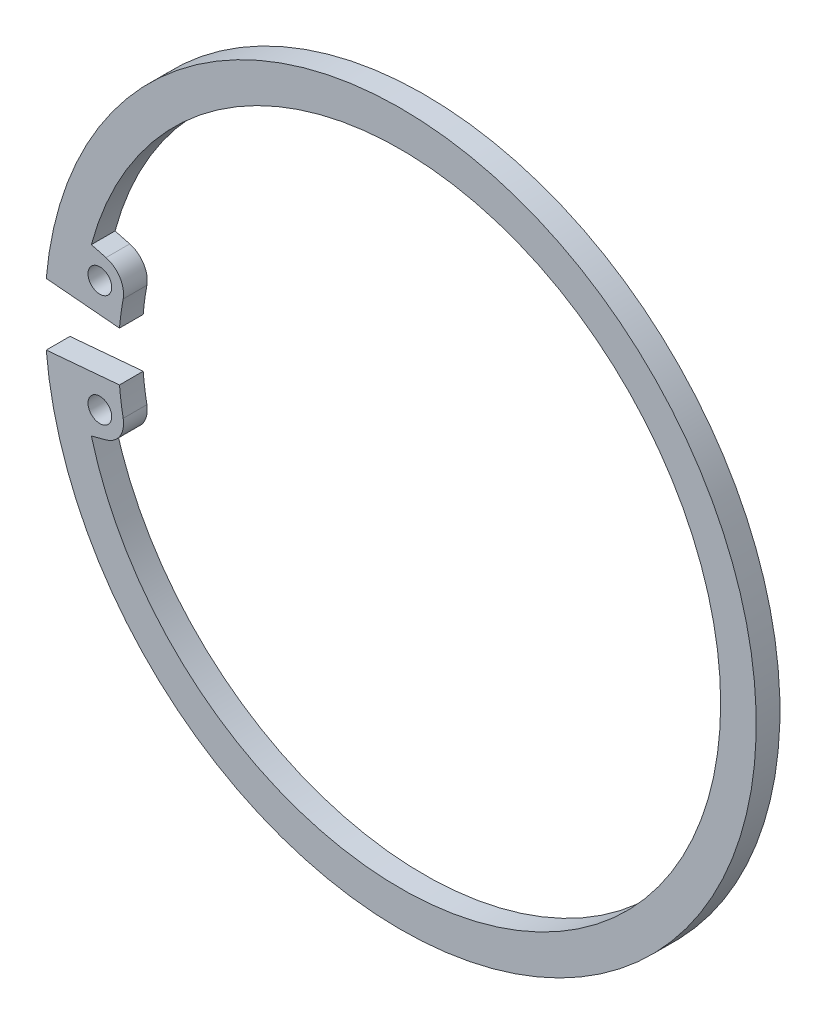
ISO-10303-21;
HEADER;
FILE_DESCRIPTION(('STEP AP214'),'2;1');
FILE_NAME('part.step','',(''),(''),'','','');
FILE_SCHEMA(('AUTOMOTIVE_DESIGN { 1 0 10303 214 1 1 1 1 }'));
ENDSEC;
DATA;
#1=APPLICATION_CONTEXT('core data for automotive mechanical design processes');
#2=APPLICATION_PROTOCOL_DEFINITION('international standard','automotive_design',2000,#1);
#3=PRODUCT_CONTEXT('',#1,'mechanical');
#4=PRODUCT('Part','Part','',(#3));
#5=PRODUCT_RELATED_PRODUCT_CATEGORY('part','',(#4));
#6=PRODUCT_DEFINITION_FORMATION('','',#4);
#7=PRODUCT_DEFINITION_CONTEXT('part definition',#1,'design');
#8=PRODUCT_DEFINITION('design','',#6,#7);
#9=PRODUCT_DEFINITION_SHAPE('','',#8);
#10=(LENGTH_UNIT() NAMED_UNIT(*) SI_UNIT(.MILLI.,.METRE.));
#11=(NAMED_UNIT(*) PLANE_ANGLE_UNIT() SI_UNIT($,.RADIAN.));
#12=(NAMED_UNIT(*) SI_UNIT($,.STERADIAN.) SOLID_ANGLE_UNIT());
#13=UNCERTAINTY_MEASURE_WITH_UNIT(LENGTH_MEASURE(1.E-05),#10,'distance_accuracy_value','');
#14=(GEOMETRIC_REPRESENTATION_CONTEXT(3) GLOBAL_UNCERTAINTY_ASSIGNED_CONTEXT((#13)) GLOBAL_UNIT_ASSIGNED_CONTEXT((#10,
#11,#12)) REPRESENTATION_CONTEXT('',''));
#15=CARTESIAN_POINT('',(0.,0.,0.));
#16=DIRECTION('',(0.,0.,1.));
#17=DIRECTION('',(1.,0.,0.));
#18=AXIS2_PLACEMENT_3D('',#15,#16,#17);
#19=CARTESIAN_POINT('',(0.,0.,1.));
#20=DIRECTION('',(0.,0.,-1.));
#21=DIRECTION('',(-1.,0.,0.));
#22=AXIS2_PLACEMENT_3D('',#19,#20,#21);
#23=PLANE('',#22);
#24=CARTESIAN_POINT('',(-12.6817668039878,2.36279299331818,1.));
#25=DIRECTION('',(0.,0.,1.));
#26=DIRECTION('',(1.,0.,0.));
#27=AXIS2_PLACEMENT_3D('',#24,#25,#26);
#28=CIRCLE('',#27,0.500000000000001);
#29=CARTESIAN_POINT('',(-12.1817668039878,2.36279299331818,1.));
#30=VERTEX_POINT('',#29);
#31=EDGE_CURVE('E127',#30,#30,#28,.T.);
#32=ORIENTED_EDGE('',*,*,#31,.F.);
#33=EDGE_LOOP('',(#32));
#34=FACE_BOUND('',#33,.T.);
#35=CARTESIAN_POINT('',(0.,0.,1.));
#36=DIRECTION('',(0.,0.,-1.));
#37=DIRECTION('',(-1.,0.,0.));
#38=AXIS2_PLACEMENT_3D('',#35,#36,#37);
#39=CIRCLE('',#38,13.5);
#40=CARTESIAN_POINT('',(-13.0399986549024,3.49405710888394,1.));
#41=VERTEX_POINT('',#40);
#42=CARTESIAN_POINT('',(-13.0399986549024,-3.49405710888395,1.));
#43=VERTEX_POINT('',#42);
#44=EDGE_CURVE('E150',#41,#43,#39,.T.);
#45=ORIENTED_EDGE('',*,*,#44,.T.);
#46=DIRECTION('',(0.965925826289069,0.258819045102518,0.));
#47=VECTOR('',#46,1.);
#48=CARTESIAN_POINT('',(-12.4229477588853,-3.32871881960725,1.));
#49=LINE('',#48,#47);
#50=CARTESIAN_POINT('',(-12.4229477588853,-3.32871881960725,1.));
#51=VERTEX_POINT('',#50);
#52=EDGE_CURVE('E122',#43,#51,#49,.T.);
#53=ORIENTED_EDGE('',*,*,#52,.T.);
#54=CARTESIAN_POINT('',(-12.6817668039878,-2.36279299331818,1.));
#55=DIRECTION('',(0.,0.,1.));
#56=DIRECTION('',(-1.,0.,0.));
#57=AXIS2_PLACEMENT_3D('',#54,#55,#56);
#58=CIRCLE('',#57,1.);
#59=CARTESIAN_POINT('',(-11.6986841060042,-2.17963074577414,1.));
#60=VERTEX_POINT('',#59);
#61=EDGE_CURVE('E153',#51,#60,#58,.T.);
#62=ORIENTED_EDGE('',*,*,#61,.T.);
#63=CARTESIAN_POINT('',(0.,0.,1.));
#64=DIRECTION('',(0.,0.,-1.));
#65=DIRECTION('',(-1.,0.,0.));
#66=AXIS2_PLACEMENT_3D('',#63,#64,#65);
#67=CIRCLE('',#66,11.9);
#68=CARTESIAN_POINT('',(-11.8547169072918,-1.03715333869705,1.));
#69=VERTEX_POINT('',#68);
#70=EDGE_CURVE('E155',#60,#69,#67,.T.);
#71=ORIENTED_EDGE('',*,*,#70,.T.);
#72=DIRECTION('',(-0.996194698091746,-0.0871557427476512,0.));
#73=VECTOR('',#72,1.);
#74=CARTESIAN_POINT('',(-14.9429204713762,-1.30733614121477,1.));
#75=LINE('',#74,#73);
#76=CARTESIAN_POINT('',(-14.9429204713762,-1.30733614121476,1.));
#77=VERTEX_POINT('',#76);
#78=EDGE_CURVE('E157',#69,#77,#75,.T.);
#79=ORIENTED_EDGE('',*,*,#78,.T.);
#80=CARTESIAN_POINT('',(0.,0.,1.));
#81=DIRECTION('',(0.,0.,1.));
#82=DIRECTION('',(1.,0.,0.));
#83=AXIS2_PLACEMENT_3D('',#80,#81,#82);
#84=CIRCLE('',#83,15.);
#85=CARTESIAN_POINT('',(-14.9429204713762,1.30733614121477,1.));
#86=VERTEX_POINT('',#85);
#87=EDGE_CURVE('E159',#77,#86,#84,.T.);
#88=ORIENTED_EDGE('',*,*,#87,.T.);
#89=DIRECTION('',(0.996194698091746,-0.0871557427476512,0.));
#90=VECTOR('',#89,1.);
#91=CARTESIAN_POINT('',(-14.9429204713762,1.30733614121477,1.));
#92=LINE('',#91,#90);
#93=CARTESIAN_POINT('',(-11.8547169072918,1.03715333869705,1.));
#94=VERTEX_POINT('',#93);
#95=EDGE_CURVE('E161',#86,#94,#92,.T.);
#96=ORIENTED_EDGE('',*,*,#95,.T.);
#97=CARTESIAN_POINT('',(0.,0.,1.));
#98=DIRECTION('',(0.,0.,-1.));
#99=DIRECTION('',(1.,0.,0.));
#100=AXIS2_PLACEMENT_3D('',#97,#98,#99);
#101=CIRCLE('',#100,11.9);
#102=CARTESIAN_POINT('',(-11.6986841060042,2.17963074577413,1.));
#103=VERTEX_POINT('',#102);
#104=EDGE_CURVE('E163',#94,#103,#101,.T.);
#105=ORIENTED_EDGE('',*,*,#104,.T.);
#106=CARTESIAN_POINT('',(-12.6817668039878,2.36279299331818,1.));
#107=DIRECTION('',(0.,0.,1.));
#108=DIRECTION('',(1.,0.,0.));
#109=AXIS2_PLACEMENT_3D('',#106,#107,#108);
#110=CIRCLE('',#109,1.);
#111=CARTESIAN_POINT('',(-12.4229477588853,3.32871881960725,1.));
#112=VERTEX_POINT('',#111);
#113=EDGE_CURVE('E51',#103,#112,#110,.T.);
#114=ORIENTED_EDGE('',*,*,#113,.T.);
#115=DIRECTION('',(-0.96592582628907,0.258819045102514,0.));
#116=VECTOR('',#115,1.);
#117=CARTESIAN_POINT('',(-13.0399986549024,3.49405710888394,1.));
#118=LINE('',#117,#116);
#119=EDGE_CURVE('E46',#112,#41,#118,.T.);
#120=ORIENTED_EDGE('',*,*,#119,.T.);
#121=EDGE_LOOP('',(#45,#53,#62,#71,#79,#88,#96,#105,#114,#120));
#122=FACE_BOUND('',#121,.T.);
#123=CARTESIAN_POINT('',(-12.6817668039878,-2.36279299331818,1.));
#124=DIRECTION('',(0.,0.,1.));
#125=DIRECTION('',(-1.,0.,0.));
#126=AXIS2_PLACEMENT_3D('',#123,#124,#125);
#127=CIRCLE('',#126,0.500000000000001);
#128=CARTESIAN_POINT('',(-13.1817668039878,-2.36279299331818,1.));
#129=VERTEX_POINT('',#128);
#130=EDGE_CURVE('E249',#129,#129,#127,.T.);
#131=ORIENTED_EDGE('',*,*,#130,.F.);
#132=EDGE_LOOP('',(#131));
#133=FACE_BOUND('',#132,.T.);
#134=ADVANCED_FACE('F31',(#34,#122,#133),#23,.F.);
#135=CARTESIAN_POINT('',(0.,0.,0.));
#136=DIRECTION('',(0.,0.,-1.));
#137=DIRECTION('',(-1.,0.,0.));
#138=AXIS2_PLACEMENT_3D('',#135,#136,#137);
#139=PLANE('',#138);
#140=CARTESIAN_POINT('',(-12.6817668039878,2.36279299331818,0.));
#141=DIRECTION('',(0.,0.,1.));
#142=DIRECTION('',(1.,0.,0.));
#143=AXIS2_PLACEMENT_3D('',#140,#141,#142);
#144=CIRCLE('',#143,0.500000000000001);
#145=CARTESIAN_POINT('',(-12.1817668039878,2.36279299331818,0.));
#146=VERTEX_POINT('',#145);
#147=EDGE_CURVE('E130',#146,#146,#144,.T.);
#148=ORIENTED_EDGE('',*,*,#147,.T.);
#149=EDGE_LOOP('',(#148));
#150=FACE_BOUND('',#149,.T.);
#151=CARTESIAN_POINT('',(0.,0.,0.));
#152=DIRECTION('',(0.,0.,-1.));
#153=DIRECTION('',(-1.,0.,0.));
#154=AXIS2_PLACEMENT_3D('',#151,#152,#153);
#155=CIRCLE('',#154,13.5);
#156=CARTESIAN_POINT('',(-13.0399986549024,3.49405710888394,0.));
#157=VERTEX_POINT('',#156);
#158=CARTESIAN_POINT('',(-13.0399986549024,-3.49405710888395,0.));
#159=VERTEX_POINT('',#158);
#160=EDGE_CURVE('E113',#157,#159,#155,.T.);
#161=ORIENTED_EDGE('',*,*,#160,.F.);
#162=DIRECTION('',(-0.96592582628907,0.258819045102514,0.));
#163=VECTOR('',#162,1.);
#164=CARTESIAN_POINT('',(-13.0399986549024,3.49405710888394,0.));
#165=LINE('',#164,#163);
#166=CARTESIAN_POINT('',(-12.4229477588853,3.32871881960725,0.));
#167=VERTEX_POINT('',#166);
#168=EDGE_CURVE('E148',#167,#157,#165,.T.);
#169=ORIENTED_EDGE('',*,*,#168,.F.);
#170=CARTESIAN_POINT('',(-12.6817668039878,2.36279299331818,0.));
#171=DIRECTION('',(0.,0.,1.));
#172=DIRECTION('',(1.,0.,0.));
#173=AXIS2_PLACEMENT_3D('',#170,#171,#172);
#174=CIRCLE('',#173,1.);
#175=CARTESIAN_POINT('',(-11.6986841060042,2.17963074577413,0.));
#176=VERTEX_POINT('',#175);
#177=EDGE_CURVE('E146',#176,#167,#174,.T.);
#178=ORIENTED_EDGE('',*,*,#177,.F.);
#179=CARTESIAN_POINT('',(0.,0.,0.));
#180=DIRECTION('',(0.,0.,-1.));
#181=DIRECTION('',(1.,0.,0.));
#182=AXIS2_PLACEMENT_3D('',#179,#180,#181);
#183=CIRCLE('',#182,11.9);
#184=CARTESIAN_POINT('',(-11.8547169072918,1.03715333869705,0.));
#185=VERTEX_POINT('',#184);
#186=EDGE_CURVE('E144',#185,#176,#183,.T.);
#187=ORIENTED_EDGE('',*,*,#186,.F.);
#188=DIRECTION('',(0.996194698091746,-0.0871557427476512,0.));
#189=VECTOR('',#188,1.);
#190=CARTESIAN_POINT('',(-14.9429204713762,1.30733614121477,0.));
#191=LINE('',#190,#189);
#192=CARTESIAN_POINT('',(-14.9429204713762,1.30733614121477,0.));
#193=VERTEX_POINT('',#192);
#194=EDGE_CURVE('E142',#193,#185,#191,.T.);
#195=ORIENTED_EDGE('',*,*,#194,.F.);
#196=CARTESIAN_POINT('',(0.,0.,0.));
#197=DIRECTION('',(0.,0.,1.));
#198=DIRECTION('',(1.,0.,0.));
#199=AXIS2_PLACEMENT_3D('',#196,#197,#198);
#200=CIRCLE('',#199,15.);
#201=CARTESIAN_POINT('',(-14.9429204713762,-1.30733614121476,0.));
#202=VERTEX_POINT('',#201);
#203=EDGE_CURVE('E140',#202,#193,#200,.T.);
#204=ORIENTED_EDGE('',*,*,#203,.F.);
#205=DIRECTION('',(-0.996194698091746,-0.0871557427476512,0.));
#206=VECTOR('',#205,1.);
#207=CARTESIAN_POINT('',(-14.9429204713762,-1.30733614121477,0.));
#208=LINE('',#207,#206);
#209=CARTESIAN_POINT('',(-11.8547169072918,-1.03715333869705,0.));
#210=VERTEX_POINT('',#209);
#211=EDGE_CURVE('E137',#210,#202,#208,.T.);
#212=ORIENTED_EDGE('',*,*,#211,.F.);
#213=CARTESIAN_POINT('',(0.,0.,0.));
#214=DIRECTION('',(0.,0.,-1.));
#215=DIRECTION('',(-1.,0.,0.));
#216=AXIS2_PLACEMENT_3D('',#213,#214,#215);
#217=CIRCLE('',#216,11.9);
#218=CARTESIAN_POINT('',(-11.6986841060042,-2.17963074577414,0.));
#219=VERTEX_POINT('',#218);
#220=EDGE_CURVE('E135',#219,#210,#217,.T.);
#221=ORIENTED_EDGE('',*,*,#220,.F.);
#222=CARTESIAN_POINT('',(-12.6817668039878,-2.36279299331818,0.));
#223=DIRECTION('',(0.,0.,1.));
#224=DIRECTION('',(-1.,0.,0.));
#225=AXIS2_PLACEMENT_3D('',#222,#223,#224);
#226=CIRCLE('',#225,1.);
#227=CARTESIAN_POINT('',(-12.4229477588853,-3.32871881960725,0.));
#228=VERTEX_POINT('',#227);
#229=EDGE_CURVE('E115',#228,#219,#226,.T.);
#230=ORIENTED_EDGE('',*,*,#229,.F.);
#231=DIRECTION('',(0.965925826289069,0.258819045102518,0.));
#232=VECTOR('',#231,1.);
#233=CARTESIAN_POINT('',(-12.4229477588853,-3.32871881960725,0.));
#234=LINE('',#233,#232);
#235=EDGE_CURVE('E108',#159,#228,#234,.T.);
#236=ORIENTED_EDGE('',*,*,#235,.F.);
#237=EDGE_LOOP('',(#161,#169,#178,#187,#195,#204,#212,#221,#230,#236));
#238=FACE_BOUND('',#237,.T.);
#239=CARTESIAN_POINT('',(-12.6817668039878,-2.36279299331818,0.));
#240=DIRECTION('',(0.,0.,1.));
#241=DIRECTION('',(-1.,0.,0.));
#242=AXIS2_PLACEMENT_3D('',#239,#240,#241);
#243=CIRCLE('',#242,0.500000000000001);
#244=CARTESIAN_POINT('',(-13.1817668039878,-2.36279299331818,0.));
#245=VERTEX_POINT('',#244);
#246=EDGE_CURVE('E252',#245,#245,#243,.T.);
#247=ORIENTED_EDGE('',*,*,#246,.T.);
#248=EDGE_LOOP('',(#247));
#249=FACE_BOUND('',#248,.T.);
#250=ADVANCED_FACE('F109',(#150,#238,#249),#139,.T.);
#251=CARTESIAN_POINT('',(0.,0.,1.));
#252=DIRECTION('',(0.,0.,-1.));
#253=DIRECTION('',(-1.,0.,0.));
#254=AXIS2_PLACEMENT_3D('',#251,#252,#253);
#255=CYLINDRICAL_SURFACE('',#254,13.5);
#256=ORIENTED_EDGE('',*,*,#160,.T.);
#257=DIRECTION('',(0.,0.,-1.));
#258=VECTOR('',#257,1.);
#259=CARTESIAN_POINT('',(-13.0399986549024,-3.49405710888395,1.));
#260=LINE('',#259,#258);
#261=EDGE_CURVE('E11',#43,#159,#260,.T.);
#262=ORIENTED_EDGE('',*,*,#261,.F.);
#263=ORIENTED_EDGE('',*,*,#44,.F.);
#264=DIRECTION('',(0.,0.,-1.));
#265=VECTOR('',#264,1.);
#266=CARTESIAN_POINT('',(-13.0399986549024,3.49405710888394,1.));
#267=LINE('',#266,#265);
#268=EDGE_CURVE('E126',#41,#157,#267,.T.);
#269=ORIENTED_EDGE('',*,*,#268,.T.);
#270=EDGE_LOOP('',(#256,#262,#263,#269));
#271=FACE_BOUND('',#270,.T.);
#272=ADVANCED_FACE('F33',(#271),#255,.F.);
#273=CARTESIAN_POINT('',(-12.4229477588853,-3.32871881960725,1.));
#274=DIRECTION('',(-0.258819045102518,0.965925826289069,0.));
#275=DIRECTION('',(-0.965925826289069,-0.258819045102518,0.));
#276=AXIS2_PLACEMENT_3D('',#273,#274,#275);
#277=PLANE('',#276);
#278=ORIENTED_EDGE('',*,*,#235,.T.);
#279=DIRECTION('',(0.,0.,-1.));
#280=VECTOR('',#279,1.);
#281=CARTESIAN_POINT('',(-12.4229477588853,-3.32871881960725,1.));
#282=LINE('',#281,#280);
#283=EDGE_CURVE('E39',#51,#228,#282,.T.);
#284=ORIENTED_EDGE('',*,*,#283,.F.);
#285=ORIENTED_EDGE('',*,*,#52,.F.);
#286=ORIENTED_EDGE('',*,*,#261,.T.);
#287=EDGE_LOOP('',(#278,#284,#285,#286));
#288=FACE_BOUND('',#287,.T.);
#289=ADVANCED_FACE('F121',(#288),#277,.F.);
#290=CARTESIAN_POINT('',(-12.6817668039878,-2.36279299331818,1.));
#291=DIRECTION('',(0.,0.,-1.));
#292=DIRECTION('',(-1.,0.,0.));
#293=AXIS2_PLACEMENT_3D('',#290,#291,#292);
#294=CYLINDRICAL_SURFACE('',#293,1.);
#295=ORIENTED_EDGE('',*,*,#229,.T.);
#296=DIRECTION('',(0.,0.,-1.));
#297=VECTOR('',#296,1.);
#298=CARTESIAN_POINT('',(-11.6986841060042,-2.17963074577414,1.));
#299=LINE('',#298,#297);
#300=EDGE_CURVE('E186',#60,#219,#299,.T.);
#301=ORIENTED_EDGE('',*,*,#300,.F.);
#302=ORIENTED_EDGE('',*,*,#61,.F.);
#303=ORIENTED_EDGE('',*,*,#283,.T.);
#304=EDGE_LOOP('',(#295,#301,#302,#303));
#305=FACE_BOUND('',#304,.T.);
#306=ADVANCED_FACE('F190',(#305),#294,.T.);
#307=CARTESIAN_POINT('',(0.,0.,1.));
#308=DIRECTION('',(0.,0.,-1.));
#309=DIRECTION('',(-1.,0.,0.));
#310=AXIS2_PLACEMENT_3D('',#307,#308,#309);
#311=CYLINDRICAL_SURFACE('',#310,11.9);
#312=ORIENTED_EDGE('',*,*,#220,.T.);
#313=DIRECTION('',(0.,0.,-1.));
#314=VECTOR('',#313,1.);
#315=CARTESIAN_POINT('',(-11.8547169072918,-1.03715333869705,1.));
#316=LINE('',#315,#314);
#317=EDGE_CURVE('E183',#69,#210,#316,.T.);
#318=ORIENTED_EDGE('',*,*,#317,.F.);
#319=ORIENTED_EDGE('',*,*,#70,.F.);
#320=ORIENTED_EDGE('',*,*,#300,.T.);
#321=EDGE_LOOP('',(#312,#318,#319,#320));
#322=FACE_BOUND('',#321,.T.);
#323=ADVANCED_FACE('F198',(#322),#311,.F.);
#324=CARTESIAN_POINT('',(-14.9429204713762,-1.30733614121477,1.));
#325=DIRECTION('',(0.0871557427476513,-0.996194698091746,0.));
#326=DIRECTION('',(0.996194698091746,0.0871557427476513,0.));
#327=AXIS2_PLACEMENT_3D('',#324,#325,#326);
#328=PLANE('',#327);
#329=ORIENTED_EDGE('',*,*,#211,.T.);
#330=DIRECTION('',(0.,0.,-1.));
#331=VECTOR('',#330,1.);
#332=CARTESIAN_POINT('',(-14.9429204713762,-1.30733614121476,1.));
#333=LINE('',#332,#331);
#334=EDGE_CURVE('E180',#77,#202,#333,.T.);
#335=ORIENTED_EDGE('',*,*,#334,.F.);
#336=ORIENTED_EDGE('',*,*,#78,.F.);
#337=ORIENTED_EDGE('',*,*,#317,.T.);
#338=EDGE_LOOP('',(#329,#335,#336,#337));
#339=FACE_BOUND('',#338,.T.);
#340=ADVANCED_FACE('F201',(#339),#328,.F.);
#341=CARTESIAN_POINT('',(0.,0.,1.));
#342=DIRECTION('',(0.,0.,-1.));
#343=DIRECTION('',(-1.,0.,0.));
#344=AXIS2_PLACEMENT_3D('',#341,#342,#343);
#345=CYLINDRICAL_SURFACE('',#344,15.);
#346=ORIENTED_EDGE('',*,*,#203,.T.);
#347=DIRECTION('',(0.,0.,-1.));
#348=VECTOR('',#347,1.);
#349=CARTESIAN_POINT('',(-14.9429204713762,1.30733614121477,1.));
#350=LINE('',#349,#348);
#351=EDGE_CURVE('E177',#86,#193,#350,.T.);
#352=ORIENTED_EDGE('',*,*,#351,.F.);
#353=ORIENTED_EDGE('',*,*,#87,.F.);
#354=ORIENTED_EDGE('',*,*,#334,.T.);
#355=EDGE_LOOP('',(#346,#352,#353,#354));
#356=FACE_BOUND('',#355,.T.);
#357=ADVANCED_FACE('F205',(#356),#345,.T.);
#358=CARTESIAN_POINT('',(-14.9429204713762,1.30733614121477,1.));
#359=DIRECTION('',(0.0871557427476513,0.996194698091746,0.));
#360=DIRECTION('',(-0.996194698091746,0.0871557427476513,0.));
#361=AXIS2_PLACEMENT_3D('',#358,#359,#360);
#362=PLANE('',#361);
#363=ORIENTED_EDGE('',*,*,#194,.T.);
#364=DIRECTION('',(0.,0.,-1.));
#365=VECTOR('',#364,1.);
#366=CARTESIAN_POINT('',(-11.8547169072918,1.03715333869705,1.));
#367=LINE('',#366,#365);
#368=EDGE_CURVE('E174',#94,#185,#367,.T.);
#369=ORIENTED_EDGE('',*,*,#368,.F.);
#370=ORIENTED_EDGE('',*,*,#95,.F.);
#371=ORIENTED_EDGE('',*,*,#351,.T.);
#372=EDGE_LOOP('',(#363,#369,#370,#371));
#373=FACE_BOUND('',#372,.T.);
#374=ADVANCED_FACE('F211',(#373),#362,.F.);
#375=CARTESIAN_POINT('',(0.,0.,1.));
#376=DIRECTION('',(0.,0.,-1.));
#377=DIRECTION('',(-1.,0.,0.));
#378=AXIS2_PLACEMENT_3D('',#375,#376,#377);
#379=CYLINDRICAL_SURFACE('',#378,11.9);
#380=ORIENTED_EDGE('',*,*,#186,.T.);
#381=DIRECTION('',(0.,0.,-1.));
#382=VECTOR('',#381,1.);
#383=CARTESIAN_POINT('',(-11.6986841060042,2.17963074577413,1.));
#384=LINE('',#383,#382);
#385=EDGE_CURVE('E171',#103,#176,#384,.T.);
#386=ORIENTED_EDGE('',*,*,#385,.F.);
#387=ORIENTED_EDGE('',*,*,#104,.F.);
#388=ORIENTED_EDGE('',*,*,#368,.T.);
#389=EDGE_LOOP('',(#380,#386,#387,#388));
#390=FACE_BOUND('',#389,.T.);
#391=ADVANCED_FACE('F215',(#390),#379,.F.);
#392=CARTESIAN_POINT('',(-12.6817668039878,2.36279299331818,1.));
#393=DIRECTION('',(0.,0.,-1.));
#394=DIRECTION('',(-1.,0.,0.));
#395=AXIS2_PLACEMENT_3D('',#392,#393,#394);
#396=CYLINDRICAL_SURFACE('',#395,1.);
#397=ORIENTED_EDGE('',*,*,#177,.T.);
#398=DIRECTION('',(0.,0.,-1.));
#399=VECTOR('',#398,1.);
#400=CARTESIAN_POINT('',(-12.4229477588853,3.32871881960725,1.));
#401=LINE('',#400,#399);
#402=EDGE_CURVE('E168',#112,#167,#401,.T.);
#403=ORIENTED_EDGE('',*,*,#402,.F.);
#404=ORIENTED_EDGE('',*,*,#113,.F.);
#405=ORIENTED_EDGE('',*,*,#385,.T.);
#406=EDGE_LOOP('',(#397,#403,#404,#405));
#407=FACE_BOUND('',#406,.T.);
#408=ADVANCED_FACE('F218',(#407),#396,.T.);
#409=CARTESIAN_POINT('',(-13.0399986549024,3.49405710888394,1.));
#410=DIRECTION('',(-0.258819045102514,-0.96592582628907,0.));
#411=DIRECTION('',(0.96592582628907,-0.258819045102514,0.));
#412=AXIS2_PLACEMENT_3D('',#409,#410,#411);
#413=PLANE('',#412);
#414=ORIENTED_EDGE('',*,*,#168,.T.);
#415=ORIENTED_EDGE('',*,*,#268,.F.);
#416=ORIENTED_EDGE('',*,*,#119,.F.);
#417=ORIENTED_EDGE('',*,*,#402,.T.);
#418=EDGE_LOOP('',(#414,#415,#416,#417));
#419=FACE_BOUND('',#418,.T.);
#420=ADVANCED_FACE('F220',(#419),#413,.F.);
#421=CARTESIAN_POINT('',(-12.6817668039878,2.36279299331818,1.));
#422=DIRECTION('',(0.,0.,-1.));
#423=DIRECTION('',(-1.,0.,0.));
#424=AXIS2_PLACEMENT_3D('',#421,#422,#423);
#425=CYLINDRICAL_SURFACE('',#424,0.500000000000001);
#426=ORIENTED_EDGE('',*,*,#31,.T.);
#427=EDGE_LOOP('',(#426));
#428=FACE_BOUND('',#427,.T.);
#429=ORIENTED_EDGE('',*,*,#147,.F.);
#430=EDGE_LOOP('',(#429));
#431=FACE_BOUND('',#430,.T.);
#432=ADVANCED_FACE('F222',(#428,#431),#425,.F.);
#433=CARTESIAN_POINT('',(-12.6817668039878,-2.36279299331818,1.));
#434=DIRECTION('',(0.,0.,-1.));
#435=DIRECTION('',(-1.,0.,0.));
#436=AXIS2_PLACEMENT_3D('',#433,#434,#435);
#437=CYLINDRICAL_SURFACE('',#436,0.500000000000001);
#438=ORIENTED_EDGE('',*,*,#130,.T.);
#439=EDGE_LOOP('',(#438));
#440=FACE_BOUND('',#439,.T.);
#441=ORIENTED_EDGE('',*,*,#246,.F.);
#442=EDGE_LOOP('',(#441));
#443=FACE_BOUND('',#442,.T.);
#444=ADVANCED_FACE('F228',(#440,#443),#437,.F.);
#445=CLOSED_SHELL('',(#134,#250,#272,#289,#306,#323,#340,#357,#374,#391,#408,#420,#432,#444));
#446=MANIFOLD_SOLID_BREP('B2',#445);
#447=ADVANCED_BREP_SHAPE_REPRESENTATION('',(#18,#446),#14);
#448=SHAPE_DEFINITION_REPRESENTATION(#9,#447);
ENDSEC;
END-ISO-10303-21;
